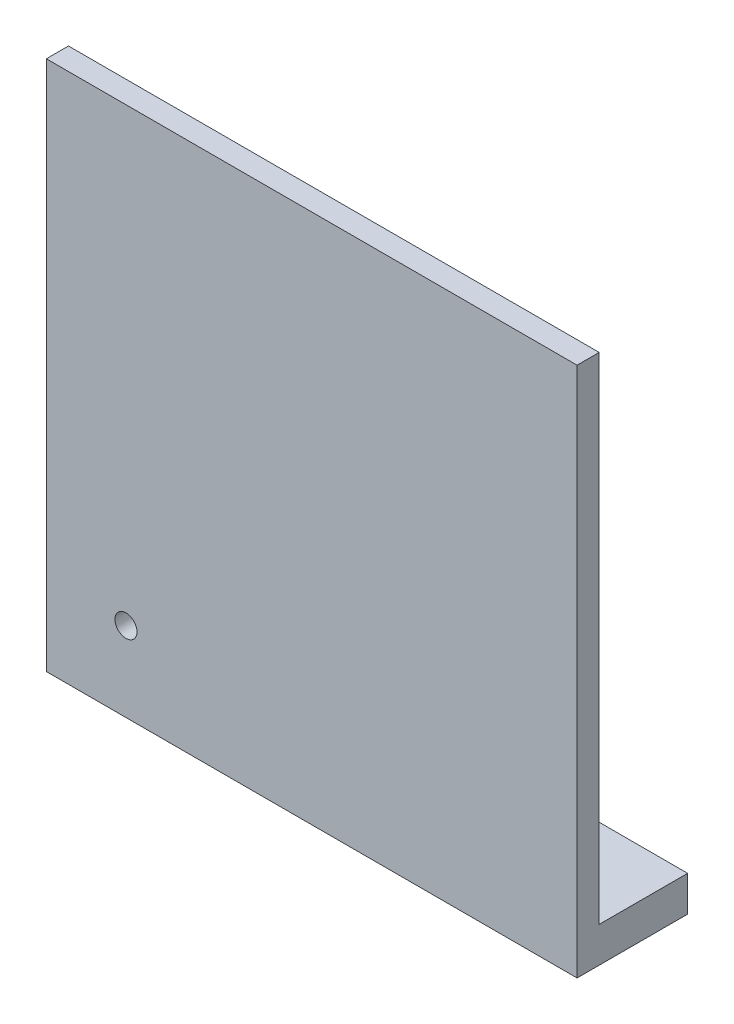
ISO-10303-21;
HEADER;
FILE_DESCRIPTION(('STEP AP214'),'2;1');
FILE_NAME('part.step','',(''),(''),'','','');
FILE_SCHEMA(('AUTOMOTIVE_DESIGN { 1 0 10303 214 1 1 1 1 }'));
ENDSEC;
DATA;
#1=APPLICATION_CONTEXT('core data for automotive mechanical design processes');
#2=APPLICATION_PROTOCOL_DEFINITION('international standard','automotive_design',2000,#1);
#3=PRODUCT_CONTEXT('',#1,'mechanical');
#4=PRODUCT('Part','Part','',(#3));
#5=PRODUCT_RELATED_PRODUCT_CATEGORY('part','',(#4));
#6=PRODUCT_DEFINITION_FORMATION('','',#4);
#7=PRODUCT_DEFINITION_CONTEXT('part definition',#1,'design');
#8=PRODUCT_DEFINITION('design','',#6,#7);
#9=PRODUCT_DEFINITION_SHAPE('','',#8);
#10=(LENGTH_UNIT() NAMED_UNIT(*) SI_UNIT(.MILLI.,.METRE.));
#11=(NAMED_UNIT(*) PLANE_ANGLE_UNIT() SI_UNIT($,.RADIAN.));
#12=(NAMED_UNIT(*) SI_UNIT($,.STERADIAN.) SOLID_ANGLE_UNIT());
#13=UNCERTAINTY_MEASURE_WITH_UNIT(LENGTH_MEASURE(1.E-05),#10,'distance_accuracy_value','');
#14=(GEOMETRIC_REPRESENTATION_CONTEXT(3) GLOBAL_UNCERTAINTY_ASSIGNED_CONTEXT((#13)) GLOBAL_UNIT_ASSIGNED_CONTEXT((#10,
#11,#12)) REPRESENTATION_CONTEXT('',''));
#15=CARTESIAN_POINT('',(0.,0.,0.));
#16=DIRECTION('',(0.,0.,1.));
#17=DIRECTION('',(1.,0.,0.));
#18=AXIS2_PLACEMENT_3D('',#15,#16,#17);
#19=CARTESIAN_POINT('',(0.,0.,-50.));
#20=DIRECTION('',(-1.,0.,0.));
#21=DIRECTION('',(0.,0.,1.));
#22=AXIS2_PLACEMENT_3D('',#19,#20,#21);
#23=PLANE('',#22);
#24=DIRECTION('',(0.,-1.,0.));
#25=VECTOR('',#24,1.);
#26=CARTESIAN_POINT('',(0.,0.,0.));
#27=LINE('',#26,#25);
#28=CARTESIAN_POINT('',(0.,1200.,0.));
#29=VERTEX_POINT('',#28);
#30=CARTESIAN_POINT('',(0.,0.,0.));
#31=VERTEX_POINT('',#30);
#32=EDGE_CURVE('E80',#29,#31,#27,.T.);
#33=ORIENTED_EDGE('',*,*,#32,.F.);
#34=DIRECTION('',(0.,0.,1.));
#35=VECTOR('',#34,1.);
#36=CARTESIAN_POINT('',(0.,1200.,-50.));
#37=LINE('',#36,#35);
#38=CARTESIAN_POINT('',(0.,1200.,-50.));
#39=VERTEX_POINT('',#38);
#40=EDGE_CURVE('E11',#39,#29,#37,.T.);
#41=ORIENTED_EDGE('',*,*,#40,.F.);
#42=DIRECTION('',(0.,-1.,0.));
#43=VECTOR('',#42,1.);
#44=CARTESIAN_POINT('',(0.,0.,-50.));
#45=LINE('',#44,#43);
#46=CARTESIAN_POINT('',(0.,80.,-50.));
#47=VERTEX_POINT('',#46);
#48=EDGE_CURVE('E94',#39,#47,#45,.T.);
#49=ORIENTED_EDGE('',*,*,#48,.T.);
#50=DIRECTION('',(0.,0.,1.));
#51=VECTOR('',#50,1.);
#52=CARTESIAN_POINT('',(0.,80.0000000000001,-250.));
#53=LINE('',#52,#51);
#54=CARTESIAN_POINT('',(0.,80.0000000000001,-250.));
#55=VERTEX_POINT('',#54);
#56=EDGE_CURVE('E88',#55,#47,#53,.T.);
#57=ORIENTED_EDGE('',*,*,#56,.F.);
#58=DIRECTION('',(0.,1.,0.));
#59=VECTOR('',#58,1.);
#60=CARTESIAN_POINT('',(0.,0.,-250.));
#61=LINE('',#60,#59);
#62=CARTESIAN_POINT('',(0.,0.,-250.));
#63=VERTEX_POINT('',#62);
#64=EDGE_CURVE('E154',#63,#55,#61,.T.);
#65=ORIENTED_EDGE('',*,*,#64,.F.);
#66=DIRECTION('',(0.,0.,1.));
#67=VECTOR('',#66,1.);
#68=CARTESIAN_POINT('',(0.,0.,-50.));
#69=LINE('',#68,#67);
#70=EDGE_CURVE('E83',#63,#31,#69,.T.);
#71=ORIENTED_EDGE('',*,*,#70,.T.);
#72=EDGE_LOOP('',(#33,#41,#49,#57,#65,#71));
#73=FACE_BOUND('',#72,.T.);
#74=ADVANCED_FACE('F33',(#73),#23,.T.);
#75=CARTESIAN_POINT('',(0.,1200.,-50.));
#76=DIRECTION('',(0.,1.,0.));
#77=DIRECTION('',(0.,0.,1.));
#78=AXIS2_PLACEMENT_3D('',#75,#76,#77);
#79=PLANE('',#78);
#80=DIRECTION('',(-1.,0.,0.));
#81=VECTOR('',#80,1.);
#82=CARTESIAN_POINT('',(0.,1200.,0.));
#83=LINE('',#82,#81);
#84=CARTESIAN_POINT('',(1200.,1200.,0.));
#85=VERTEX_POINT('',#84);
#86=EDGE_CURVE('E76',#85,#29,#83,.T.);
#87=ORIENTED_EDGE('',*,*,#86,.F.);
#88=DIRECTION('',(0.,0.,1.));
#89=VECTOR('',#88,1.);
#90=CARTESIAN_POINT('',(1200.,1200.,-50.));
#91=LINE('',#90,#89);
#92=CARTESIAN_POINT('',(1200.,1200.,-50.));
#93=VERTEX_POINT('',#92);
#94=EDGE_CURVE('E41',#93,#85,#91,.T.);
#95=ORIENTED_EDGE('',*,*,#94,.F.);
#96=DIRECTION('',(-1.,0.,0.));
#97=VECTOR('',#96,1.);
#98=CARTESIAN_POINT('',(0.,1200.,-50.));
#99=LINE('',#98,#97);
#100=EDGE_CURVE('E78',#93,#39,#99,.T.);
#101=ORIENTED_EDGE('',*,*,#100,.T.);
#102=ORIENTED_EDGE('',*,*,#40,.T.);
#103=EDGE_LOOP('',(#87,#95,#101,#102));
#104=FACE_BOUND('',#103,.T.);
#105=ADVANCED_FACE('F73',(#104),#79,.T.);
#106=CARTESIAN_POINT('',(1200.,0.,-50.));
#107=DIRECTION('',(1.,0.,0.));
#108=DIRECTION('',(0.,0.,-1.));
#109=AXIS2_PLACEMENT_3D('',#106,#107,#108);
#110=PLANE('',#109);
#111=DIRECTION('',(0.,1.,0.));
#112=VECTOR('',#111,1.);
#113=CARTESIAN_POINT('',(1200.,0.,0.));
#114=LINE('',#113,#112);
#115=CARTESIAN_POINT('',(1200.,0.,0.));
#116=VERTEX_POINT('',#115);
#117=EDGE_CURVE('E93',#116,#85,#114,.T.);
#118=ORIENTED_EDGE('',*,*,#117,.F.);
#119=DIRECTION('',(0.,0.,1.));
#120=VECTOR('',#119,1.);
#121=CARTESIAN_POINT('',(1200.,0.,-50.));
#122=LINE('',#121,#120);
#123=CARTESIAN_POINT('',(1200.,0.,-250.));
#124=VERTEX_POINT('',#123);
#125=EDGE_CURVE('E102',#124,#116,#122,.T.);
#126=ORIENTED_EDGE('',*,*,#125,.F.);
#127=DIRECTION('',(0.,-1.,0.));
#128=VECTOR('',#127,1.);
#129=CARTESIAN_POINT('',(1200.,0.,-250.));
#130=LINE('',#129,#128);
#131=CARTESIAN_POINT('',(1200.,80.,-250.));
#132=VERTEX_POINT('',#131);
#133=EDGE_CURVE('E142',#132,#124,#130,.T.);
#134=ORIENTED_EDGE('',*,*,#133,.F.);
#135=DIRECTION('',(0.,0.,1.));
#136=VECTOR('',#135,1.);
#137=CARTESIAN_POINT('',(1200.,80.,-250.));
#138=LINE('',#137,#136);
#139=CARTESIAN_POINT('',(1200.,80.,-50.));
#140=VERTEX_POINT('',#139);
#141=EDGE_CURVE('E138',#132,#140,#138,.T.);
#142=ORIENTED_EDGE('',*,*,#141,.T.);
#143=DIRECTION('',(0.,1.,0.));
#144=VECTOR('',#143,1.);
#145=CARTESIAN_POINT('',(1200.,0.,-50.));
#146=LINE('',#145,#144);
#147=EDGE_CURVE('E96',#140,#93,#146,.T.);
#148=ORIENTED_EDGE('',*,*,#147,.T.);
#149=ORIENTED_EDGE('',*,*,#94,.T.);
#150=EDGE_LOOP('',(#118,#126,#134,#142,#148,#149));
#151=FACE_BOUND('',#150,.T.);
#152=ADVANCED_FACE('F125',(#151),#110,.T.);
#153=CARTESIAN_POINT('',(0.,0.,-50.));
#154=DIRECTION('',(0.,-1.,0.));
#155=DIRECTION('',(0.,0.,-1.));
#156=AXIS2_PLACEMENT_3D('',#153,#154,#155);
#157=PLANE('',#156);
#158=DIRECTION('',(1.,0.,0.));
#159=VECTOR('',#158,1.);
#160=CARTESIAN_POINT('',(0.,0.,0.));
#161=LINE('',#160,#159);
#162=EDGE_CURVE('E87',#31,#116,#161,.T.);
#163=ORIENTED_EDGE('',*,*,#162,.F.);
#164=ORIENTED_EDGE('',*,*,#70,.F.);
#165=DIRECTION('',(-1.,0.,0.));
#166=VECTOR('',#165,1.);
#167=CARTESIAN_POINT('',(1200.,0.,-250.));
#168=LINE('',#167,#166);
#169=EDGE_CURVE('E121',#124,#63,#168,.T.);
#170=ORIENTED_EDGE('',*,*,#169,.F.);
#171=ORIENTED_EDGE('',*,*,#125,.T.);
#172=EDGE_LOOP('',(#163,#164,#170,#171));
#173=FACE_BOUND('',#172,.T.);
#174=ADVANCED_FACE('F115',(#173),#157,.T.);
#175=CARTESIAN_POINT('',(0.,1200.,-50.));
#176=DIRECTION('',(0.,0.,-1.));
#177=DIRECTION('',(-1.,0.,0.));
#178=AXIS2_PLACEMENT_3D('',#175,#176,#177);
#179=PLANE('',#178);
#180=CARTESIAN_POINT('',(180.,180.,-50.));
#181=DIRECTION('',(0.,0.,-1.));
#182=DIRECTION('',(-1.,0.,0.));
#183=AXIS2_PLACEMENT_3D('',#180,#181,#182);
#184=CIRCLE('',#183,25.);
#185=CARTESIAN_POINT('',(155.,180.,-50.));
#186=VERTEX_POINT('',#185);
#187=EDGE_CURVE('E143',#186,#186,#184,.T.);
#188=ORIENTED_EDGE('',*,*,#187,.F.);
#189=EDGE_LOOP('',(#188));
#190=FACE_BOUND('',#189,.T.);
#191=DIRECTION('',(1.,0.,0.));
#192=VECTOR('',#191,1.);
#193=CARTESIAN_POINT('',(1200.,80.,-50.));
#194=LINE('',#193,#192);
#195=EDGE_CURVE('E49',#47,#140,#194,.T.);
#196=ORIENTED_EDGE('',*,*,#195,.F.);
#197=ORIENTED_EDGE('',*,*,#48,.F.);
#198=ORIENTED_EDGE('',*,*,#100,.F.);
#199=ORIENTED_EDGE('',*,*,#147,.F.);
#200=EDGE_LOOP('',(#196,#197,#198,#199));
#201=FACE_BOUND('',#200,.T.);
#202=ADVANCED_FACE('F127',(#190,#201),#179,.T.);
#203=CARTESIAN_POINT('',(0.,1200.,0.));
#204=DIRECTION('',(0.,0.,-1.));
#205=DIRECTION('',(-1.,0.,0.));
#206=AXIS2_PLACEMENT_3D('',#203,#204,#205);
#207=PLANE('',#206);
#208=CARTESIAN_POINT('',(180.,180.,0.));
#209=DIRECTION('',(0.,0.,1.));
#210=DIRECTION('',(1.,0.,0.));
#211=AXIS2_PLACEMENT_3D('',#208,#209,#210);
#212=CIRCLE('',#211,25.);
#213=CARTESIAN_POINT('',(205.,180.,0.));
#214=VERTEX_POINT('',#213);
#215=EDGE_CURVE('E146',#214,#214,#212,.T.);
#216=ORIENTED_EDGE('',*,*,#215,.F.);
#217=EDGE_LOOP('',(#216));
#218=FACE_BOUND('',#217,.T.);
#219=ORIENTED_EDGE('',*,*,#32,.T.);
#220=ORIENTED_EDGE('',*,*,#162,.T.);
#221=ORIENTED_EDGE('',*,*,#117,.T.);
#222=ORIENTED_EDGE('',*,*,#86,.T.);
#223=EDGE_LOOP('',(#219,#220,#221,#222));
#224=FACE_BOUND('',#223,.T.);
#225=ADVANCED_FACE('F91',(#218,#224),#207,.F.);
#226=CARTESIAN_POINT('',(1200.,80.,-250.));
#227=DIRECTION('',(0.,-1.,0.));
#228=DIRECTION('',(1.,0.,0.));
#229=AXIS2_PLACEMENT_3D('',#226,#227,#228);
#230=PLANE('',#229);
#231=ORIENTED_EDGE('',*,*,#195,.T.);
#232=ORIENTED_EDGE('',*,*,#141,.F.);
#233=DIRECTION('',(1.,0.,0.));
#234=VECTOR('',#233,1.);
#235=CARTESIAN_POINT('',(1200.,80.,-250.));
#236=LINE('',#235,#234);
#237=EDGE_CURVE('E137',#55,#132,#236,.T.);
#238=ORIENTED_EDGE('',*,*,#237,.F.);
#239=ORIENTED_EDGE('',*,*,#56,.T.);
#240=EDGE_LOOP('',(#231,#232,#238,#239));
#241=FACE_BOUND('',#240,.T.);
#242=ADVANCED_FACE('F134',(#241),#230,.F.);
#243=CARTESIAN_POINT('',(1200.,80.,-250.));
#244=DIRECTION('',(0.,0.,1.));
#245=DIRECTION('',(1.,0.,0.));
#246=AXIS2_PLACEMENT_3D('',#243,#244,#245);
#247=PLANE('',#246);
#248=ORIENTED_EDGE('',*,*,#133,.T.);
#249=ORIENTED_EDGE('',*,*,#169,.T.);
#250=ORIENTED_EDGE('',*,*,#64,.T.);
#251=ORIENTED_EDGE('',*,*,#237,.T.);
#252=EDGE_LOOP('',(#248,#249,#250,#251));
#253=FACE_BOUND('',#252,.T.);
#254=ADVANCED_FACE('F157',(#253),#247,.F.);
#255=CARTESIAN_POINT('',(180.,180.,-250.000025));
#256=DIRECTION('',(0.,0.,1.));
#257=DIRECTION('',(1.,0.,0.));
#258=AXIS2_PLACEMENT_3D('',#255,#256,#257);
#259=CYLINDRICAL_SURFACE('',#258,25.);
#260=ORIENTED_EDGE('',*,*,#187,.T.);
#261=EDGE_LOOP('',(#260));
#262=FACE_BOUND('',#261,.T.);
#263=ORIENTED_EDGE('',*,*,#215,.T.);
#264=EDGE_LOOP('',(#263));
#265=FACE_BOUND('',#264,.T.);
#266=ADVANCED_FACE('F163',(#262,#265),#259,.F.);
#267=CLOSED_SHELL('',(#74,#105,#152,#174,#202,#225,#242,#254,#266));
#268=MANIFOLD_SOLID_BREP('B2',#267);
#269=ADVANCED_BREP_SHAPE_REPRESENTATION('',(#18,#268),#14);
#270=SHAPE_DEFINITION_REPRESENTATION(#9,#269);
ENDSEC;
END-ISO-10303-21;
